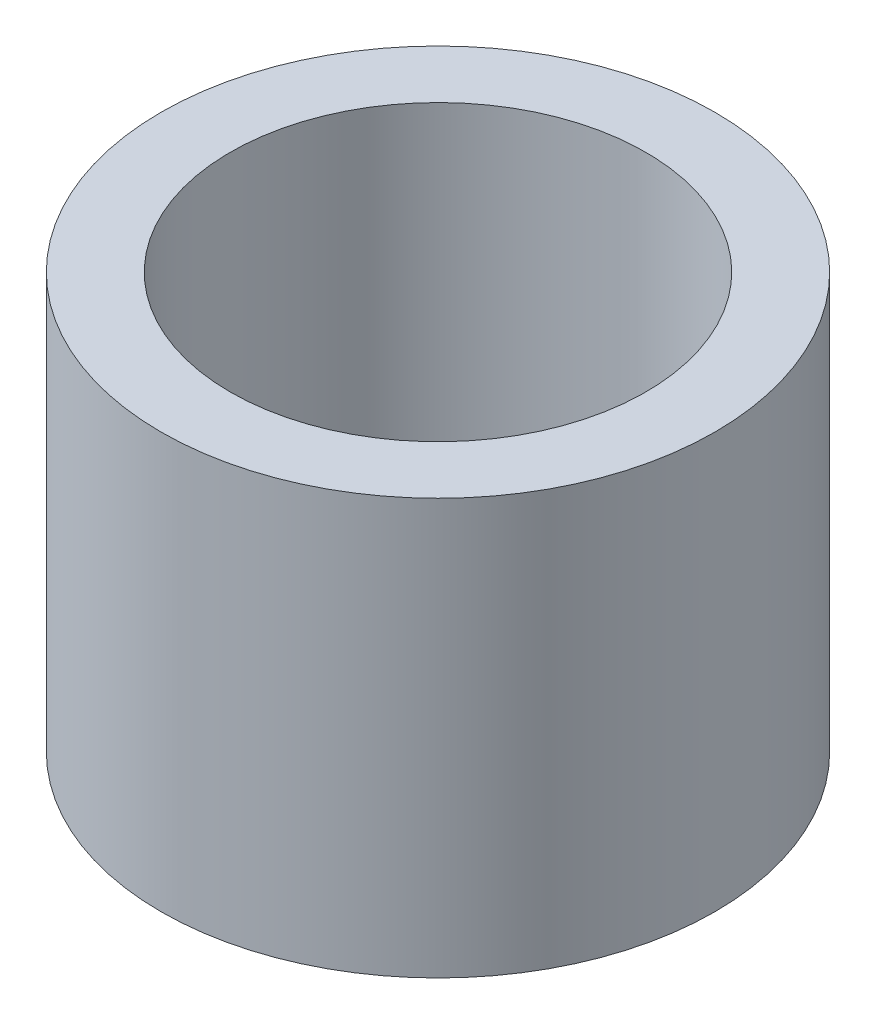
ISO-10303-21;
HEADER;
FILE_DESCRIPTION(('STEP AP214'),'2;1');
FILE_NAME('part.step','',(''),(''),'','','');
FILE_SCHEMA(('AUTOMOTIVE_DESIGN { 1 0 10303 214 1 1 1 1 }'));
ENDSEC;
DATA;
#1=APPLICATION_CONTEXT('core data for automotive mechanical design processes');
#2=APPLICATION_PROTOCOL_DEFINITION('international standard','automotive_design',2000,#1);
#3=PRODUCT_CONTEXT('',#1,'mechanical');
#4=PRODUCT('Part','Part','',(#3));
#5=PRODUCT_RELATED_PRODUCT_CATEGORY('part','',(#4));
#6=PRODUCT_DEFINITION_FORMATION('','',#4);
#7=PRODUCT_DEFINITION_CONTEXT('part definition',#1,'design');
#8=PRODUCT_DEFINITION('design','',#6,#7);
#9=PRODUCT_DEFINITION_SHAPE('','',#8);
#10=(LENGTH_UNIT() NAMED_UNIT(*) SI_UNIT(.MILLI.,.METRE.));
#11=(NAMED_UNIT(*) PLANE_ANGLE_UNIT() SI_UNIT($,.RADIAN.));
#12=(NAMED_UNIT(*) SI_UNIT($,.STERADIAN.) SOLID_ANGLE_UNIT());
#13=UNCERTAINTY_MEASURE_WITH_UNIT(LENGTH_MEASURE(1.E-05),#10,'distance_accuracy_value','');
#14=(GEOMETRIC_REPRESENTATION_CONTEXT(3) GLOBAL_UNCERTAINTY_ASSIGNED_CONTEXT((#13)) GLOBAL_UNIT_ASSIGNED_CONTEXT((#10,
#11,#12)) REPRESENTATION_CONTEXT('',''));
#15=CARTESIAN_POINT('',(0.,0.,0.));
#16=DIRECTION('',(0.,0.,1.));
#17=DIRECTION('',(1.,0.,0.));
#18=AXIS2_PLACEMENT_3D('',#15,#16,#17);
#19=CARTESIAN_POINT('',(0.,3.,0.));
#20=DIRECTION('',(0.,1.,0.));
#21=DIRECTION('',(0.,0.,1.));
#22=AXIS2_PLACEMENT_3D('',#19,#20,#21);
#23=PLANE('',#22);
#24=CARTESIAN_POINT('',(0.,3.,0.));
#25=DIRECTION('',(0.,1.,0.));
#26=DIRECTION('',(0.,0.,1.));
#27=AXIS2_PLACEMENT_3D('',#24,#25,#26);
#28=CIRCLE('',#27,2.);
#29=CARTESIAN_POINT('',(0.,3.,2.));
#30=VERTEX_POINT('',#29);
#31=EDGE_CURVE('E10',#30,#30,#28,.T.);
#32=ORIENTED_EDGE('',*,*,#31,.T.);
#33=EDGE_LOOP('',(#32));
#34=FACE_BOUND('',#33,.T.);
#35=CARTESIAN_POINT('',(0.,3.,0.));
#36=DIRECTION('',(0.,1.,0.));
#37=DIRECTION('',(0.,0.,1.));
#38=AXIS2_PLACEMENT_3D('',#35,#36,#37);
#39=CIRCLE('',#38,1.5);
#40=CARTESIAN_POINT('',(0.,3.,1.5));
#41=VERTEX_POINT('',#40);
#42=EDGE_CURVE('E44',#41,#41,#39,.T.);
#43=ORIENTED_EDGE('',*,*,#42,.F.);
#44=EDGE_LOOP('',(#43));
#45=FACE_BOUND('',#44,.T.);
#46=ADVANCED_FACE('F33',(#34,#45),#23,.T.);
#47=CARTESIAN_POINT('',(0.,0.,0.));
#48=DIRECTION('',(0.,1.,0.));
#49=DIRECTION('',(0.,0.,1.));
#50=AXIS2_PLACEMENT_3D('',#47,#48,#49);
#51=PLANE('',#50);
#52=CARTESIAN_POINT('',(0.,0.,0.));
#53=DIRECTION('',(0.,1.,0.));
#54=DIRECTION('',(0.,0.,1.));
#55=AXIS2_PLACEMENT_3D('',#52,#53,#54);
#56=CIRCLE('',#55,2.);
#57=CARTESIAN_POINT('',(0.,0.,2.));
#58=VERTEX_POINT('',#57);
#59=EDGE_CURVE('E37',#58,#58,#56,.T.);
#60=ORIENTED_EDGE('',*,*,#59,.F.);
#61=EDGE_LOOP('',(#60));
#62=FACE_BOUND('',#61,.T.);
#63=CARTESIAN_POINT('',(0.,0.,0.));
#64=DIRECTION('',(0.,1.,0.));
#65=DIRECTION('',(0.,0.,1.));
#66=AXIS2_PLACEMENT_3D('',#63,#64,#65);
#67=CIRCLE('',#66,1.5);
#68=CARTESIAN_POINT('',(0.,0.,1.5));
#69=VERTEX_POINT('',#68);
#70=EDGE_CURVE('E46',#69,#69,#67,.T.);
#71=ORIENTED_EDGE('',*,*,#70,.T.);
#72=EDGE_LOOP('',(#71));
#73=FACE_BOUND('',#72,.T.);
#74=ADVANCED_FACE('F56',(#62,#73),#51,.F.);
#75=CARTESIAN_POINT('',(0.,3.,0.));
#76=DIRECTION('',(0.,-1.,0.));
#77=DIRECTION('',(0.,0.,-1.));
#78=AXIS2_PLACEMENT_3D('',#75,#76,#77);
#79=CYLINDRICAL_SURFACE('',#78,2.);
#80=ORIENTED_EDGE('',*,*,#31,.F.);
#81=EDGE_LOOP('',(#80));
#82=FACE_BOUND('',#81,.T.);
#83=ORIENTED_EDGE('',*,*,#59,.T.);
#84=EDGE_LOOP('',(#83));
#85=FACE_BOUND('',#84,.T.);
#86=ADVANCED_FACE('F35',(#82,#85),#79,.T.);
#87=CARTESIAN_POINT('',(0.,3.,0.));
#88=DIRECTION('',(0.,-1.,0.));
#89=DIRECTION('',(0.,0.,-1.));
#90=AXIS2_PLACEMENT_3D('',#87,#88,#89);
#91=CYLINDRICAL_SURFACE('',#90,1.5);
#92=ORIENTED_EDGE('',*,*,#42,.T.);
#93=EDGE_LOOP('',(#92));
#94=FACE_BOUND('',#93,.T.);
#95=ORIENTED_EDGE('',*,*,#70,.F.);
#96=EDGE_LOOP('',(#95));
#97=FACE_BOUND('',#96,.T.);
#98=ADVANCED_FACE('F52',(#94,#97),#91,.F.);
#99=CLOSED_SHELL('',(#46,#74,#86,#98));
#100=MANIFOLD_SOLID_BREP('B2',#99);
#101=ADVANCED_BREP_SHAPE_REPRESENTATION('',(#18,#100),#14);
#102=SHAPE_DEFINITION_REPRESENTATION(#9,#101);
ENDSEC;
END-ISO-10303-21;
